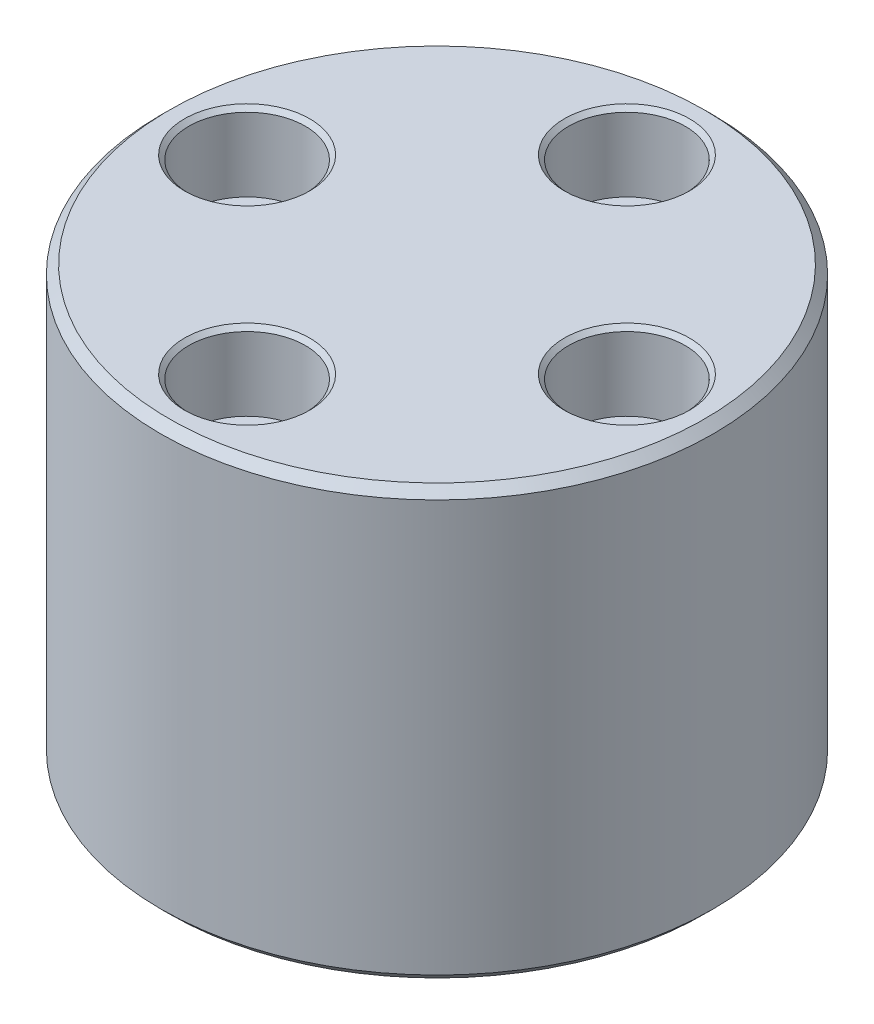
ISO-10303-21;
HEADER;
FILE_DESCRIPTION(('STEP AP214'),'2;1');
FILE_NAME('part.step','',(''),(''),'','','');
FILE_SCHEMA(('AUTOMOTIVE_DESIGN { 1 0 10303 214 1 1 1 1 }'));
ENDSEC;
DATA;
#1=APPLICATION_CONTEXT('core data for automotive mechanical design processes');
#2=APPLICATION_PROTOCOL_DEFINITION('international standard','automotive_design',2000,#1);
#3=PRODUCT_CONTEXT('',#1,'mechanical');
#4=PRODUCT('Part','Part','',(#3));
#5=PRODUCT_RELATED_PRODUCT_CATEGORY('part','',(#4));
#6=PRODUCT_DEFINITION_FORMATION('','',#4);
#7=PRODUCT_DEFINITION_CONTEXT('part definition',#1,'design');
#8=PRODUCT_DEFINITION('design','',#6,#7);
#9=PRODUCT_DEFINITION_SHAPE('','',#8);
#10=(LENGTH_UNIT() NAMED_UNIT(*) SI_UNIT(.MILLI.,.METRE.));
#11=(NAMED_UNIT(*) PLANE_ANGLE_UNIT() SI_UNIT($,.RADIAN.));
#12=(NAMED_UNIT(*) SI_UNIT($,.STERADIAN.) SOLID_ANGLE_UNIT());
#13=UNCERTAINTY_MEASURE_WITH_UNIT(LENGTH_MEASURE(1.E-05),#10,'distance_accuracy_value','');
#14=(GEOMETRIC_REPRESENTATION_CONTEXT(3) GLOBAL_UNCERTAINTY_ASSIGNED_CONTEXT((#13)) GLOBAL_UNIT_ASSIGNED_CONTEXT((#10,
#11,#12)) REPRESENTATION_CONTEXT('',''));
#15=CARTESIAN_POINT('',(0.,0.,0.));
#16=DIRECTION('',(0.,0.,1.));
#17=DIRECTION('',(1.,0.,0.));
#18=AXIS2_PLACEMENT_3D('',#15,#16,#17);
#19=CARTESIAN_POINT('',(0.,39.4208,0.));
#20=DIRECTION('',(0.,-1.,0.));
#21=DIRECTION('',(0.,0.,-1.));
#22=AXIS2_PLACEMENT_3D('',#19,#20,#21);
#23=CYLINDRICAL_SURFACE('',#22,25.4);
#24=CARTESIAN_POINT('',(0.,38.62705,0.));
#25=DIRECTION('',(0.,1.,0.));
#26=DIRECTION('',(0.,0.,1.));
#27=AXIS2_PLACEMENT_3D('',#24,#25,#26);
#28=CIRCLE('',#27,25.4);
#29=CARTESIAN_POINT('',(0.,38.62705,-25.4));
#30=VERTEX_POINT('',#29);
#31=EDGE_CURVE('E91',#30,#30,#28,.F.);
#32=ORIENTED_EDGE('',*,*,#31,.T.);
#33=EDGE_LOOP('',(#32));
#34=FACE_BOUND('',#33,.T.);
#35=CARTESIAN_POINT('',(0.,0.79375000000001,0.));
#36=DIRECTION('',(0.,1.,0.));
#37=DIRECTION('',(0.,0.,1.));
#38=AXIS2_PLACEMENT_3D('',#35,#36,#37);
#39=CIRCLE('',#38,25.4);
#40=CARTESIAN_POINT('',(0.,0.79375000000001,25.4));
#41=VERTEX_POINT('',#40);
#42=EDGE_CURVE('E94',#41,#41,#39,.T.);
#43=ORIENTED_EDGE('',*,*,#42,.T.);
#44=EDGE_LOOP('',(#43));
#45=FACE_BOUND('',#44,.T.);
#46=ADVANCED_FACE('F32',(#34,#45),#23,.T.);
#47=CARTESIAN_POINT('',(0.,39.4208,0.));
#48=DIRECTION('',(0.,1.,0.));
#49=DIRECTION('',(0.,0.,1.));
#50=AXIS2_PLACEMENT_3D('',#47,#48,#49);
#51=PLANE('',#50);
#52=CARTESIAN_POINT('',(0.,39.4208,17.4625));
#53=DIRECTION('',(0.,1.,0.));
#54=DIRECTION('',(0.,0.,1.));
#55=AXIS2_PLACEMENT_3D('',#52,#53,#54);
#56=CIRCLE('',#55,5.75627500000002);
#57=CARTESIAN_POINT('',(0.,39.4208,23.218775));
#58=VERTEX_POINT('',#57);
#59=EDGE_CURVE('E47',#58,#58,#56,.F.);
#60=ORIENTED_EDGE('',*,*,#59,.T.);
#61=EDGE_LOOP('',(#60));
#62=FACE_BOUND('',#61,.T.);
#63=CARTESIAN_POINT('',(17.4625,39.4208,0.));
#64=DIRECTION('',(0.,1.,0.));
#65=DIRECTION('',(0.,0.,1.));
#66=AXIS2_PLACEMENT_3D('',#63,#64,#65);
#67=CIRCLE('',#66,5.75627500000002);
#68=CARTESIAN_POINT('',(17.4625,39.4208,5.75627500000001));
#69=VERTEX_POINT('',#68);
#70=EDGE_CURVE('E52',#69,#69,#67,.F.);
#71=ORIENTED_EDGE('',*,*,#70,.T.);
#72=EDGE_LOOP('',(#71));
#73=FACE_BOUND('',#72,.T.);
#74=CARTESIAN_POINT('',(0.,39.4208,-17.4625));
#75=DIRECTION('',(0.,1.,0.));
#76=DIRECTION('',(0.,0.,1.));
#77=AXIS2_PLACEMENT_3D('',#74,#75,#76);
#78=CIRCLE('',#77,5.75627500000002);
#79=CARTESIAN_POINT('',(0.,39.4208,-11.706225));
#80=VERTEX_POINT('',#79);
#81=EDGE_CURVE('E55',#80,#80,#78,.F.);
#82=ORIENTED_EDGE('',*,*,#81,.T.);
#83=EDGE_LOOP('',(#82));
#84=FACE_BOUND('',#83,.T.);
#85=CARTESIAN_POINT('',(-17.4625,39.4208,0.));
#86=DIRECTION('',(0.,1.,0.));
#87=DIRECTION('',(0.,0.,1.));
#88=AXIS2_PLACEMENT_3D('',#85,#86,#87);
#89=CIRCLE('',#88,5.75627500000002);
#90=CARTESIAN_POINT('',(-17.4625,39.4208,5.75627500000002));
#91=VERTEX_POINT('',#90);
#92=EDGE_CURVE('E58',#91,#91,#89,.F.);
#93=ORIENTED_EDGE('',*,*,#92,.T.);
#94=EDGE_LOOP('',(#93));
#95=FACE_BOUND('',#94,.T.);
#96=CARTESIAN_POINT('',(0.,39.4208,0.));
#97=DIRECTION('',(0.,1.,0.));
#98=DIRECTION('',(0.,0.,1.));
#99=AXIS2_PLACEMENT_3D('',#96,#97,#98);
#100=CIRCLE('',#99,24.60625);
#101=CARTESIAN_POINT('',(0.,39.4208,-24.60625));
#102=VERTEX_POINT('',#101);
#103=EDGE_CURVE('E97',#102,#102,#100,.T.);
#104=ORIENTED_EDGE('',*,*,#103,.T.);
#105=EDGE_LOOP('',(#104));
#106=FACE_BOUND('',#105,.T.);
#107=ADVANCED_FACE('F142',(#62,#73,#84,#95,#106),#51,.T.);
#108=CARTESIAN_POINT('',(0.,0.,0.));
#109=DIRECTION('',(0.,1.,0.));
#110=DIRECTION('',(0.,0.,1.));
#111=AXIS2_PLACEMENT_3D('',#108,#109,#110);
#112=PLANE('',#111);
#113=CARTESIAN_POINT('',(0.,0.,17.4625));
#114=DIRECTION('',(0.,1.,0.));
#115=DIRECTION('',(0.,0.,1.));
#116=AXIS2_PLACEMENT_3D('',#113,#114,#115);
#117=CIRCLE('',#116,3.96811499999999);
#118=CARTESIAN_POINT('',(0.,0.,21.430615));
#119=VERTEX_POINT('',#118);
#120=EDGE_CURVE('E76',#119,#119,#117,.T.);
#121=ORIENTED_EDGE('',*,*,#120,.T.);
#122=EDGE_LOOP('',(#121));
#123=FACE_BOUND('',#122,.T.);
#124=CARTESIAN_POINT('',(17.4625,0.,0.));
#125=DIRECTION('',(0.,1.,0.));
#126=DIRECTION('',(0.,0.,1.));
#127=AXIS2_PLACEMENT_3D('',#124,#125,#126);
#128=CIRCLE('',#127,3.96811499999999);
#129=CARTESIAN_POINT('',(17.4625,0.,3.96811499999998));
#130=VERTEX_POINT('',#129);
#131=EDGE_CURVE('E79',#130,#130,#128,.T.);
#132=ORIENTED_EDGE('',*,*,#131,.T.);
#133=EDGE_LOOP('',(#132));
#134=FACE_BOUND('',#133,.T.);
#135=CARTESIAN_POINT('',(0.,0.,-17.4625));
#136=DIRECTION('',(0.,1.,0.));
#137=DIRECTION('',(0.,0.,1.));
#138=AXIS2_PLACEMENT_3D('',#135,#136,#137);
#139=CIRCLE('',#138,3.96811499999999);
#140=CARTESIAN_POINT('',(0.,0.,-13.494385));
#141=VERTEX_POINT('',#140);
#142=EDGE_CURVE('E82',#141,#141,#139,.T.);
#143=ORIENTED_EDGE('',*,*,#142,.T.);
#144=EDGE_LOOP('',(#143));
#145=FACE_BOUND('',#144,.T.);
#146=CARTESIAN_POINT('',(-17.4625,0.,0.));
#147=DIRECTION('',(0.,1.,0.));
#148=DIRECTION('',(0.,0.,1.));
#149=AXIS2_PLACEMENT_3D('',#146,#147,#148);
#150=CIRCLE('',#149,3.96811499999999);
#151=CARTESIAN_POINT('',(-17.4625,0.,3.96811499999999));
#152=VERTEX_POINT('',#151);
#153=EDGE_CURVE('E85',#152,#152,#150,.T.);
#154=ORIENTED_EDGE('',*,*,#153,.T.);
#155=EDGE_LOOP('',(#154));
#156=FACE_BOUND('',#155,.T.);
#157=CARTESIAN_POINT('',(0.,0.,0.));
#158=DIRECTION('',(0.,1.,0.));
#159=DIRECTION('',(0.,0.,1.));
#160=AXIS2_PLACEMENT_3D('',#157,#158,#159);
#161=CIRCLE('',#160,24.60625);
#162=CARTESIAN_POINT('',(0.,0.,24.60625));
#163=VERTEX_POINT('',#162);
#164=EDGE_CURVE('E88',#163,#163,#161,.F.);
#165=ORIENTED_EDGE('',*,*,#164,.T.);
#166=EDGE_LOOP('',(#165));
#167=FACE_BOUND('',#166,.T.);
#168=ADVANCED_FACE('F148',(#123,#134,#145,#156,#167),#112,.F.);
#169=CARTESIAN_POINT('',(17.4625,39.4208,0.));
#170=DIRECTION('',(0.,1.,0.));
#171=DIRECTION('',(0.,0.,1.));
#172=AXIS2_PLACEMENT_3D('',#169,#170,#171);
#173=CYLINDRICAL_SURFACE('',#172,3.57123999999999);
#174=CARTESIAN_POINT('',(17.4625,0.396874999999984,0.));
#175=DIRECTION('',(0.,1.,0.));
#176=DIRECTION('',(0.,0.,1.));
#177=AXIS2_PLACEMENT_3D('',#174,#175,#176);
#178=CIRCLE('',#177,3.57123999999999);
#179=CARTESIAN_POINT('',(17.4625,0.396874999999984,3.57123999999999));
#180=VERTEX_POINT('',#179);
#181=EDGE_CURVE('E70',#180,#180,#178,.F.);
#182=ORIENTED_EDGE('',*,*,#181,.T.);
#183=EDGE_LOOP('',(#182));
#184=FACE_BOUND('',#183,.T.);
#185=CARTESIAN_POINT('',(17.4625,32.27832,0.));
#186=DIRECTION('',(0.,1.,0.));
#187=DIRECTION('',(0.,0.,1.));
#188=AXIS2_PLACEMENT_3D('',#185,#186,#187);
#189=CIRCLE('',#188,3.57124);
#190=CARTESIAN_POINT('',(17.4625,32.27832,3.57124));
#191=VERTEX_POINT('',#190);
#192=EDGE_CURVE('E100',#191,#191,#189,.T.);
#193=ORIENTED_EDGE('',*,*,#192,.T.);
#194=EDGE_LOOP('',(#193));
#195=FACE_BOUND('',#194,.T.);
#196=ADVANCED_FACE('F317',(#184,#195),#173,.F.);
#197=CARTESIAN_POINT('',(21.03374,32.27832,0.));
#198=DIRECTION('',(0.,-1.,0.));
#199=DIRECTION('',(0.,0.,-1.));
#200=AXIS2_PLACEMENT_3D('',#197,#198,#199);
#201=PLANE('',#200);
#202=ORIENTED_EDGE('',*,*,#192,.F.);
#203=EDGE_LOOP('',(#202));
#204=FACE_BOUND('',#203,.T.);
#205=CARTESIAN_POINT('',(17.4625,32.27832,0.));
#206=DIRECTION('',(0.,1.,0.));
#207=DIRECTION('',(0.,0.,1.));
#208=AXIS2_PLACEMENT_3D('',#205,#206,#207);
#209=CIRCLE('',#208,5.3594);
#210=CARTESIAN_POINT('',(17.4625,32.27832,5.35939999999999));
#211=VERTEX_POINT('',#210);
#212=EDGE_CURVE('E103',#211,#211,#209,.T.);
#213=ORIENTED_EDGE('',*,*,#212,.T.);
#214=EDGE_LOOP('',(#213));
#215=FACE_BOUND('',#214,.T.);
#216=ADVANCED_FACE('F309',(#204,#215),#201,.F.);
#217=CARTESIAN_POINT('',(17.4625,39.4208,0.));
#218=DIRECTION('',(0.,1.,0.));
#219=DIRECTION('',(0.,0.,1.));
#220=AXIS2_PLACEMENT_3D('',#217,#218,#219);
#221=CYLINDRICAL_SURFACE('',#220,5.3594);
#222=CARTESIAN_POINT('',(17.4625,39.023925,0.));
#223=DIRECTION('',(0.,1.,0.));
#224=DIRECTION('',(0.,0.,1.));
#225=AXIS2_PLACEMENT_3D('',#222,#223,#224);
#226=CIRCLE('',#225,5.3594);
#227=CARTESIAN_POINT('',(17.4625,39.023925,5.35939999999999));
#228=VERTEX_POINT('',#227);
#229=EDGE_CURVE('E43',#228,#228,#226,.T.);
#230=ORIENTED_EDGE('',*,*,#229,.T.);
#231=EDGE_LOOP('',(#230));
#232=FACE_BOUND('',#231,.T.);
#233=ORIENTED_EDGE('',*,*,#212,.F.);
#234=EDGE_LOOP('',(#233));
#235=FACE_BOUND('',#234,.T.);
#236=ADVANCED_FACE('F299',(#232,#235),#221,.F.);
#237=CARTESIAN_POINT('',(-17.4625,39.4208,0.));
#238=DIRECTION('',(0.,1.,0.));
#239=DIRECTION('',(0.,0.,1.));
#240=AXIS2_PLACEMENT_3D('',#237,#238,#239);
#241=CYLINDRICAL_SURFACE('',#240,3.57123999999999);
#242=CARTESIAN_POINT('',(-17.4625,0.396874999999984,0.));
#243=DIRECTION('',(0.,1.,0.));
#244=DIRECTION('',(0.,0.,1.));
#245=AXIS2_PLACEMENT_3D('',#242,#243,#244);
#246=CIRCLE('',#245,3.57123999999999);
#247=CARTESIAN_POINT('',(-17.4625,0.396874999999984,3.57123999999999));
#248=VERTEX_POINT('',#247);
#249=EDGE_CURVE('E64',#248,#248,#246,.F.);
#250=ORIENTED_EDGE('',*,*,#249,.T.);
#251=EDGE_LOOP('',(#250));
#252=FACE_BOUND('',#251,.T.);
#253=CARTESIAN_POINT('',(-17.4625,32.27832,0.));
#254=DIRECTION('',(0.,1.,0.));
#255=DIRECTION('',(0.,0.,1.));
#256=AXIS2_PLACEMENT_3D('',#253,#254,#255);
#257=CIRCLE('',#256,3.57124);
#258=CARTESIAN_POINT('',(-17.4625,32.27832,3.57124));
#259=VERTEX_POINT('',#258);
#260=EDGE_CURVE('E106',#259,#259,#257,.T.);
#261=ORIENTED_EDGE('',*,*,#260,.T.);
#262=EDGE_LOOP('',(#261));
#263=FACE_BOUND('',#262,.T.);
#264=ADVANCED_FACE('F294',(#252,#263),#241,.F.);
#265=CARTESIAN_POINT('',(-13.89126,32.27832,0.));
#266=DIRECTION('',(0.,-1.,0.));
#267=DIRECTION('',(0.,0.,-1.));
#268=AXIS2_PLACEMENT_3D('',#265,#266,#267);
#269=PLANE('',#268);
#270=ORIENTED_EDGE('',*,*,#260,.F.);
#271=EDGE_LOOP('',(#270));
#272=FACE_BOUND('',#271,.T.);
#273=CARTESIAN_POINT('',(-17.4625,32.27832,0.));
#274=DIRECTION('',(0.,1.,0.));
#275=DIRECTION('',(0.,0.,1.));
#276=AXIS2_PLACEMENT_3D('',#273,#274,#275);
#277=CIRCLE('',#276,5.3594);
#278=CARTESIAN_POINT('',(-17.4625,32.27832,5.3594));
#279=VERTEX_POINT('',#278);
#280=EDGE_CURVE('E109',#279,#279,#277,.T.);
#281=ORIENTED_EDGE('',*,*,#280,.T.);
#282=EDGE_LOOP('',(#281));
#283=FACE_BOUND('',#282,.T.);
#284=ADVANCED_FACE('F287',(#272,#283),#269,.F.);
#285=CARTESIAN_POINT('',(-17.4625,39.4208,0.));
#286=DIRECTION('',(0.,1.,0.));
#287=DIRECTION('',(0.,0.,1.));
#288=AXIS2_PLACEMENT_3D('',#285,#286,#287);
#289=CYLINDRICAL_SURFACE('',#288,5.3594);
#290=CARTESIAN_POINT('',(-17.4625,39.023925,0.));
#291=DIRECTION('',(0.,1.,0.));
#292=DIRECTION('',(0.,0.,1.));
#293=AXIS2_PLACEMENT_3D('',#290,#291,#292);
#294=CIRCLE('',#293,5.3594);
#295=CARTESIAN_POINT('',(-17.4625,39.023925,5.3594));
#296=VERTEX_POINT('',#295);
#297=EDGE_CURVE('E10',#296,#296,#294,.T.);
#298=ORIENTED_EDGE('',*,*,#297,.T.);
#299=EDGE_LOOP('',(#298));
#300=FACE_BOUND('',#299,.T.);
#301=ORIENTED_EDGE('',*,*,#280,.F.);
#302=EDGE_LOOP('',(#301));
#303=FACE_BOUND('',#302,.T.);
#304=ADVANCED_FACE('F277',(#300,#303),#289,.F.);
#305=CARTESIAN_POINT('',(0.,39.4208,17.4625));
#306=DIRECTION('',(0.,1.,0.));
#307=DIRECTION('',(0.,0.,1.));
#308=AXIS2_PLACEMENT_3D('',#305,#306,#307);
#309=CYLINDRICAL_SURFACE('',#308,3.57123999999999);
#310=CARTESIAN_POINT('',(0.,0.396874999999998,17.4625));
#311=DIRECTION('',(0.,1.,0.));
#312=DIRECTION('',(0.,0.,1.));
#313=AXIS2_PLACEMENT_3D('',#310,#311,#312);
#314=CIRCLE('',#313,3.57123999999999);
#315=CARTESIAN_POINT('',(0.,0.396874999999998,21.03374));
#316=VERTEX_POINT('',#315);
#317=EDGE_CURVE('E73',#316,#316,#314,.F.);
#318=ORIENTED_EDGE('',*,*,#317,.T.);
#319=EDGE_LOOP('',(#318));
#320=FACE_BOUND('',#319,.T.);
#321=CARTESIAN_POINT('',(0.,32.27832,17.4625));
#322=DIRECTION('',(0.,1.,0.));
#323=DIRECTION('',(0.,0.,1.));
#324=AXIS2_PLACEMENT_3D('',#321,#322,#323);
#325=CIRCLE('',#324,3.57124);
#326=CARTESIAN_POINT('',(0.,32.27832,21.03374));
#327=VERTEX_POINT('',#326);
#328=EDGE_CURVE('E112',#327,#327,#325,.T.);
#329=ORIENTED_EDGE('',*,*,#328,.T.);
#330=EDGE_LOOP('',(#329));
#331=FACE_BOUND('',#330,.T.);
#332=ADVANCED_FACE('F272',(#320,#331),#309,.F.);
#333=CARTESIAN_POINT('',(3.57124,32.27832,17.4625));
#334=DIRECTION('',(0.,-1.,0.));
#335=DIRECTION('',(0.,0.,-1.));
#336=AXIS2_PLACEMENT_3D('',#333,#334,#335);
#337=PLANE('',#336);
#338=ORIENTED_EDGE('',*,*,#328,.F.);
#339=EDGE_LOOP('',(#338));
#340=FACE_BOUND('',#339,.T.);
#341=CARTESIAN_POINT('',(0.,32.27832,17.4625));
#342=DIRECTION('',(0.,1.,0.));
#343=DIRECTION('',(0.,0.,1.));
#344=AXIS2_PLACEMENT_3D('',#341,#342,#343);
#345=CIRCLE('',#344,5.3594);
#346=CARTESIAN_POINT('',(0.,32.27832,22.8219));
#347=VERTEX_POINT('',#346);
#348=EDGE_CURVE('E115',#347,#347,#345,.T.);
#349=ORIENTED_EDGE('',*,*,#348,.T.);
#350=EDGE_LOOP('',(#349));
#351=FACE_BOUND('',#350,.T.);
#352=ADVANCED_FACE('F264',(#340,#351),#337,.F.);
#353=CARTESIAN_POINT('',(0.,39.4208,17.4625));
#354=DIRECTION('',(0.,1.,0.));
#355=DIRECTION('',(0.,0.,1.));
#356=AXIS2_PLACEMENT_3D('',#353,#354,#355);
#357=CYLINDRICAL_SURFACE('',#356,5.3594);
#358=CARTESIAN_POINT('',(0.,39.023925,17.4625));
#359=DIRECTION('',(0.,1.,0.));
#360=DIRECTION('',(0.,0.,1.));
#361=AXIS2_PLACEMENT_3D('',#358,#359,#360);
#362=CIRCLE('',#361,5.3594);
#363=CARTESIAN_POINT('',(0.,39.023925,22.8219));
#364=VERTEX_POINT('',#363);
#365=EDGE_CURVE('E61',#364,#364,#362,.T.);
#366=ORIENTED_EDGE('',*,*,#365,.T.);
#367=EDGE_LOOP('',(#366));
#368=FACE_BOUND('',#367,.T.);
#369=ORIENTED_EDGE('',*,*,#348,.F.);
#370=EDGE_LOOP('',(#369));
#371=FACE_BOUND('',#370,.T.);
#372=ADVANCED_FACE('F254',(#368,#371),#357,.F.);
#373=CARTESIAN_POINT('',(0.,39.4208,-17.4625));
#374=DIRECTION('',(0.,1.,0.));
#375=DIRECTION('',(0.,0.,1.));
#376=AXIS2_PLACEMENT_3D('',#373,#374,#375);
#377=CYLINDRICAL_SURFACE('',#376,3.57123999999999);
#378=CARTESIAN_POINT('',(0.,0.396874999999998,-17.4625));
#379=DIRECTION('',(0.,1.,0.));
#380=DIRECTION('',(0.,0.,1.));
#381=AXIS2_PLACEMENT_3D('',#378,#379,#380);
#382=CIRCLE('',#381,3.57123999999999);
#383=CARTESIAN_POINT('',(0.,0.396874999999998,-13.89126));
#384=VERTEX_POINT('',#383);
#385=EDGE_CURVE('E67',#384,#384,#382,.F.);
#386=ORIENTED_EDGE('',*,*,#385,.T.);
#387=EDGE_LOOP('',(#386));
#388=FACE_BOUND('',#387,.T.);
#389=CARTESIAN_POINT('',(0.,32.27832,-17.4625));
#390=DIRECTION('',(0.,1.,0.));
#391=DIRECTION('',(0.,0.,1.));
#392=AXIS2_PLACEMENT_3D('',#389,#390,#391);
#393=CIRCLE('',#392,3.57124);
#394=CARTESIAN_POINT('',(0.,32.27832,-13.89126));
#395=VERTEX_POINT('',#394);
#396=EDGE_CURVE('E118',#395,#395,#393,.T.);
#397=ORIENTED_EDGE('',*,*,#396,.T.);
#398=EDGE_LOOP('',(#397));
#399=FACE_BOUND('',#398,.T.);
#400=ADVANCED_FACE('F138',(#388,#399),#377,.F.);
#401=CARTESIAN_POINT('',(3.57124,32.27832,-17.4625));
#402=DIRECTION('',(0.,-1.,0.));
#403=DIRECTION('',(0.,0.,-1.));
#404=AXIS2_PLACEMENT_3D('',#401,#402,#403);
#405=PLANE('',#404);
#406=ORIENTED_EDGE('',*,*,#396,.F.);
#407=EDGE_LOOP('',(#406));
#408=FACE_BOUND('',#407,.T.);
#409=CARTESIAN_POINT('',(0.,32.27832,-17.4625));
#410=DIRECTION('',(0.,1.,0.));
#411=DIRECTION('',(0.,0.,1.));
#412=AXIS2_PLACEMENT_3D('',#409,#410,#411);
#413=CIRCLE('',#412,5.3594);
#414=CARTESIAN_POINT('',(0.,32.27832,-12.1031));
#415=VERTEX_POINT('',#414);
#416=EDGE_CURVE('E121',#415,#415,#413,.T.);
#417=ORIENTED_EDGE('',*,*,#416,.T.);
#418=EDGE_LOOP('',(#417));
#419=FACE_BOUND('',#418,.T.);
#420=ADVANCED_FACE('F125',(#408,#419),#405,.F.);
#421=CARTESIAN_POINT('',(0.,39.4208,-17.4625));
#422=DIRECTION('',(0.,1.,0.));
#423=DIRECTION('',(0.,0.,1.));
#424=AXIS2_PLACEMENT_3D('',#421,#422,#423);
#425=CYLINDRICAL_SURFACE('',#424,5.3594);
#426=CARTESIAN_POINT('',(0.,39.023925,-17.4625));
#427=DIRECTION('',(0.,1.,0.));
#428=DIRECTION('',(0.,0.,1.));
#429=AXIS2_PLACEMENT_3D('',#426,#427,#428);
#430=CIRCLE('',#429,5.3594);
#431=CARTESIAN_POINT('',(0.,39.023925,-12.1031));
#432=VERTEX_POINT('',#431);
#433=EDGE_CURVE('E39',#432,#432,#430,.T.);
#434=ORIENTED_EDGE('',*,*,#433,.T.);
#435=EDGE_LOOP('',(#434));
#436=FACE_BOUND('',#435,.T.);
#437=ORIENTED_EDGE('',*,*,#416,.F.);
#438=EDGE_LOOP('',(#437));
#439=FACE_BOUND('',#438,.T.);
#440=ADVANCED_FACE('F127',(#436,#439),#425,.F.);
#441=CARTESIAN_POINT('',(0.,39.4208,0.));
#442=DIRECTION('',(0.,-1.,0.));
#443=DIRECTION('',(0.,0.,-1.));
#444=AXIS2_PLACEMENT_3D('',#441,#442,#443);
#445=CONICAL_SURFACE('',#444,24.60625,0.785398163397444);
#446=CARTESIAN_POINT('',(0.,38.62705,-25.4));
#447=CARTESIAN_POINT('',(0.,38.6353182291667,-25.3917317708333));
#448=CARTESIAN_POINT('',(0.,38.6435864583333,-25.3834635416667));
#449=CARTESIAN_POINT('',(0.,38.6601229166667,-25.3669270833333));
#450=CARTESIAN_POINT('',(0.,38.6683911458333,-25.3586588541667));
#451=CARTESIAN_POINT('',(0.,38.6849276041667,-25.3421223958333));
#452=CARTESIAN_POINT('',(0.,38.6931958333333,-25.3338541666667));
#453=CARTESIAN_POINT('',(0.,38.7097322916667,-25.3173177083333));
#454=CARTESIAN_POINT('',(0.,38.7180005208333,-25.3090494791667));
#455=CARTESIAN_POINT('',(0.,38.7345369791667,-25.2925130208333));
#456=CARTESIAN_POINT('',(0.,38.7428052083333,-25.2842447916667));
#457=CARTESIAN_POINT('',(0.,38.7593416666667,-25.2677083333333));
#458=CARTESIAN_POINT('',(0.,38.7676098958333,-25.2594401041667));
#459=CARTESIAN_POINT('',(0.,38.7841463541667,-25.2429036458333));
#460=CARTESIAN_POINT('',(0.,38.7924145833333,-25.2346354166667));
#461=CARTESIAN_POINT('',(0.,38.8089510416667,-25.2180989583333));
#462=CARTESIAN_POINT('',(0.,38.8172192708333,-25.2098307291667));
#463=CARTESIAN_POINT('',(0.,38.8337557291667,-25.1932942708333));
#464=CARTESIAN_POINT('',(0.,38.8420239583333,-25.1850260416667));
#465=CARTESIAN_POINT('',(0.,38.8585604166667,-25.1684895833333));
#466=CARTESIAN_POINT('',(0.,38.8668286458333,-25.1602213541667));
#467=CARTESIAN_POINT('',(0.,38.8833651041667,-25.1436848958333));
#468=CARTESIAN_POINT('',(0.,38.8916333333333,-25.1354166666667));
#469=CARTESIAN_POINT('',(0.,38.9081697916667,-25.1188802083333));
#470=CARTESIAN_POINT('',(0.,38.9164380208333,-25.1106119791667));
#471=CARTESIAN_POINT('',(0.,38.9329744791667,-25.0940755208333));
#472=CARTESIAN_POINT('',(0.,38.9412427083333,-25.0858072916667));
#473=CARTESIAN_POINT('',(0.,38.9577791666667,-25.0692708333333));
#474=CARTESIAN_POINT('',(0.,38.9660473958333,-25.0610026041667));
#475=CARTESIAN_POINT('',(0.,38.9825838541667,-25.0444661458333));
#476=CARTESIAN_POINT('',(0.,38.9908520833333,-25.0361979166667));
#477=CARTESIAN_POINT('',(0.,39.0073885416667,-25.0196614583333));
#478=CARTESIAN_POINT('',(0.,39.0156567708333,-25.0113932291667));
#479=CARTESIAN_POINT('',(0.,39.0321932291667,-24.9948567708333));
#480=CARTESIAN_POINT('',(0.,39.0404614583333,-24.9865885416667));
#481=CARTESIAN_POINT('',(0.,39.0569979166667,-24.9700520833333));
#482=CARTESIAN_POINT('',(0.,39.0652661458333,-24.9617838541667));
#483=CARTESIAN_POINT('',(0.,39.0818026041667,-24.9452473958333));
#484=CARTESIAN_POINT('',(0.,39.0900708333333,-24.9369791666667));
#485=CARTESIAN_POINT('',(0.,39.1066072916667,-24.9204427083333));
#486=CARTESIAN_POINT('',(0.,39.1148755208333,-24.9121744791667));
#487=CARTESIAN_POINT('',(0.,39.1314119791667,-24.8956380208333));
#488=CARTESIAN_POINT('',(0.,39.1396802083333,-24.8873697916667));
#489=CARTESIAN_POINT('',(0.,39.1562166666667,-24.8708333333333));
#490=CARTESIAN_POINT('',(0.,39.1644848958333,-24.8625651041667));
#491=CARTESIAN_POINT('',(0.,39.1810213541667,-24.8460286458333));
#492=CARTESIAN_POINT('',(0.,39.1892895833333,-24.8377604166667));
#493=CARTESIAN_POINT('',(0.,39.2058260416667,-24.8212239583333));
#494=CARTESIAN_POINT('',(0.,39.2140942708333,-24.8129557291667));
#495=CARTESIAN_POINT('',(0.,39.2306307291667,-24.7964192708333));
#496=CARTESIAN_POINT('',(0.,39.2388989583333,-24.7881510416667));
#497=CARTESIAN_POINT('',(0.,39.2554354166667,-24.7716145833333));
#498=CARTESIAN_POINT('',(0.,39.2637036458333,-24.7633463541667));
#499=CARTESIAN_POINT('',(0.,39.2802401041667,-24.7468098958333));
#500=CARTESIAN_POINT('',(0.,39.2885083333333,-24.7385416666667));
#501=CARTESIAN_POINT('',(0.,39.3050447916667,-24.7220052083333));
#502=CARTESIAN_POINT('',(0.,39.3133130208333,-24.7137369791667));
#503=CARTESIAN_POINT('',(0.,39.3298494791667,-24.6972005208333));
#504=CARTESIAN_POINT('',(0.,39.3381177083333,-24.6889322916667));
#505=CARTESIAN_POINT('',(0.,39.3546541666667,-24.6723958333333));
#506=CARTESIAN_POINT('',(0.,39.3629223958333,-24.6641276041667));
#507=CARTESIAN_POINT('',(0.,39.3794588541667,-24.6475911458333));
#508=CARTESIAN_POINT('',(0.,39.3877270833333,-24.6393229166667));
#509=CARTESIAN_POINT('',(0.,39.4042635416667,-24.6227864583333));
#510=CARTESIAN_POINT('',(0.,39.4125317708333,-24.6145182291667));
#511=CARTESIAN_POINT('',(0.,39.4208,-24.60625));
#512=B_SPLINE_CURVE_WITH_KNOTS('',3,(#446,#447,#448,#449,#450,#451,#452,#453,#454,#455,#456,
#457,#458,#459,#460,#461,#462,#463,#464,#465,#466,#467,#468,#469,#470,#471,#472,#473,#474,#475,
#476,#477,#478,#479,#480,#481,#482,#483,#484,#485,#486,#487,#488,#489,#490,#491,#492,#493,#494,
#495,#496,#497,#498,#499,#500,#501,#502,#503,#504,#505,#506,#507,#508,#509,#510,#511),
.UNSPECIFIED.,.F.,.F.,(4,2,2,2,2,2,2,2,2,2,2,2,2,2,2,2,2,2,2,2,2,2,2,2,2,2,2,2,2,2,2,2,4),(0.,
0.0350791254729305,0.0701582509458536,0.105237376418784,0.140316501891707,0.175395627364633,
0.210474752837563,0.245553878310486,0.280633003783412,0.315712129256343,0.350791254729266,
0.385870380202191,0.420949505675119,0.456028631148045,0.491107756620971,0.526186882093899,
0.561266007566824,0.59634513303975,0.631424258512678,0.666503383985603,0.701582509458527,
0.736661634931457,0.771740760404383,0.806819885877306,0.841899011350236,0.876978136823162,
0.912057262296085,0.947136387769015,0.982215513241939,1.01729463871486,1.05237376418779,
1.08745288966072,1.12253201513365),.UNSPECIFIED.);
#513=EDGE_CURVE('BSEAM129',#30,#102,#512,.T.);
#514=ORIENTED_EDGE('',*,*,#31,.F.);
#515=ORIENTED_EDGE('',*,*,#103,.F.);
#516=ORIENTED_EDGE('',*,*,#513,.T.);
#517=ORIENTED_EDGE('',*,*,#513,.F.);
#518=EDGE_LOOP('',(#514,#516,#515,#517));
#519=FACE_BOUND('',#518,.T.);
#520=ADVANCED_FACE('F129',(#519),#445,.T.);
#521=CARTESIAN_POINT('',(0.,0.79375000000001,0.));
#522=DIRECTION('',(0.,1.,0.));
#523=DIRECTION('',(0.,0.,1.));
#524=AXIS2_PLACEMENT_3D('',#521,#522,#523);
#525=CONICAL_SURFACE('',#524,25.4,0.785398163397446);
#526=ORIENTED_EDGE('',*,*,#164,.F.);
#527=EDGE_LOOP('',(#526));
#528=FACE_BOUND('',#527,.T.);
#529=ORIENTED_EDGE('',*,*,#42,.F.);
#530=EDGE_LOOP('',(#529));
#531=FACE_BOUND('',#530,.T.);
#532=ADVANCED_FACE('F135',(#528,#531),#525,.T.);
#533=CARTESIAN_POINT('',(0.,0.,17.4625));
#534=DIRECTION('',(0.,-1.,0.));
#535=DIRECTION('',(0.,0.,-1.));
#536=AXIS2_PLACEMENT_3D('',#533,#534,#535);
#537=CONICAL_SURFACE('',#536,3.96811499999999,0.785398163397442);
#538=ORIENTED_EDGE('',*,*,#317,.F.);
#539=EDGE_LOOP('',(#538));
#540=FACE_BOUND('',#539,.T.);
#541=ORIENTED_EDGE('',*,*,#120,.F.);
#542=EDGE_LOOP('',(#541));
#543=FACE_BOUND('',#542,.T.);
#544=ADVANCED_FACE('F156',(#540,#543),#537,.F.);
#545=CARTESIAN_POINT('',(17.4625,0.,0.));
#546=DIRECTION('',(0.,-1.,0.));
#547=DIRECTION('',(0.,0.,-1.));
#548=AXIS2_PLACEMENT_3D('',#545,#546,#547);
#549=CONICAL_SURFACE('',#548,3.96811499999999,0.785398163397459);
#550=ORIENTED_EDGE('',*,*,#181,.F.);
#551=EDGE_LOOP('',(#550));
#552=FACE_BOUND('',#551,.T.);
#553=ORIENTED_EDGE('',*,*,#131,.F.);
#554=EDGE_LOOP('',(#553));
#555=FACE_BOUND('',#554,.T.);
#556=ADVANCED_FACE('F160',(#552,#555),#549,.F.);
#557=CARTESIAN_POINT('',(0.,0.,-17.4625));
#558=DIRECTION('',(0.,-1.,0.));
#559=DIRECTION('',(0.,0.,-1.));
#560=AXIS2_PLACEMENT_3D('',#557,#558,#559);
#561=CONICAL_SURFACE('',#560,3.96811499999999,0.78539816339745);
#562=ORIENTED_EDGE('',*,*,#385,.F.);
#563=EDGE_LOOP('',(#562));
#564=FACE_BOUND('',#563,.T.);
#565=ORIENTED_EDGE('',*,*,#142,.F.);
#566=EDGE_LOOP('',(#565));
#567=FACE_BOUND('',#566,.T.);
#568=ADVANCED_FACE('F164',(#564,#567),#561,.F.);
#569=CARTESIAN_POINT('',(-17.4625,0.,0.));
#570=DIRECTION('',(0.,-1.,0.));
#571=DIRECTION('',(0.,0.,-1.));
#572=AXIS2_PLACEMENT_3D('',#569,#570,#571);
#573=CONICAL_SURFACE('',#572,3.96811499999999,0.785398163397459);
#574=ORIENTED_EDGE('',*,*,#249,.F.);
#575=EDGE_LOOP('',(#574));
#576=FACE_BOUND('',#575,.T.);
#577=ORIENTED_EDGE('',*,*,#153,.F.);
#578=EDGE_LOOP('',(#577));
#579=FACE_BOUND('',#578,.T.);
#580=ADVANCED_FACE('F168',(#576,#579),#573,.F.);
#581=CARTESIAN_POINT('',(0.,39.023925,17.4625));
#582=DIRECTION('',(0.,1.,0.));
#583=DIRECTION('',(0.,0.,1.));
#584=AXIS2_PLACEMENT_3D('',#581,#582,#583);
#585=CONICAL_SURFACE('',#584,5.3594,0.785398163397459);
#586=ORIENTED_EDGE('',*,*,#59,.F.);
#587=EDGE_LOOP('',(#586));
#588=FACE_BOUND('',#587,.T.);
#589=ORIENTED_EDGE('',*,*,#365,.F.);
#590=EDGE_LOOP('',(#589));
#591=FACE_BOUND('',#590,.T.);
#592=ADVANCED_FACE('F172',(#588,#591),#585,.F.);
#593=CARTESIAN_POINT('',(17.4625,39.023925,0.));
#594=DIRECTION('',(0.,1.,0.));
#595=DIRECTION('',(0.,0.,1.));
#596=AXIS2_PLACEMENT_3D('',#593,#594,#595);
#597=CONICAL_SURFACE('',#596,5.3594,0.785398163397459);
#598=ORIENTED_EDGE('',*,*,#70,.F.);
#599=EDGE_LOOP('',(#598));
#600=FACE_BOUND('',#599,.T.);
#601=ORIENTED_EDGE('',*,*,#229,.F.);
#602=EDGE_LOOP('',(#601));
#603=FACE_BOUND('',#602,.T.);
#604=ADVANCED_FACE('F176',(#600,#603),#597,.F.);
#605=CARTESIAN_POINT('',(0.,39.023925,-17.4625));
#606=DIRECTION('',(0.,1.,0.));
#607=DIRECTION('',(0.,0.,1.));
#608=AXIS2_PLACEMENT_3D('',#605,#606,#607);
#609=CONICAL_SURFACE('',#608,5.3594,0.785398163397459);
#610=ORIENTED_EDGE('',*,*,#81,.F.);
#611=EDGE_LOOP('',(#610));
#612=FACE_BOUND('',#611,.T.);
#613=ORIENTED_EDGE('',*,*,#433,.F.);
#614=EDGE_LOOP('',(#613));
#615=FACE_BOUND('',#614,.T.);
#616=ADVANCED_FACE('F179',(#612,#615),#609,.F.);
#617=CARTESIAN_POINT('',(-17.4625,39.023925,0.));
#618=DIRECTION('',(0.,1.,0.));
#619=DIRECTION('',(0.,0.,1.));
#620=AXIS2_PLACEMENT_3D('',#617,#618,#619);
#621=CONICAL_SURFACE('',#620,5.3594,0.78539816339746);
#622=ORIENTED_EDGE('',*,*,#92,.F.);
#623=EDGE_LOOP('',(#622));
#624=FACE_BOUND('',#623,.T.);
#625=ORIENTED_EDGE('',*,*,#297,.F.);
#626=EDGE_LOOP('',(#625));
#627=FACE_BOUND('',#626,.T.);
#628=ADVANCED_FACE('F34',(#624,#627),#621,.F.);
#629=CLOSED_SHELL('',(#46,#107,#168,#196,#216,#236,#264,#284,#304,#332,#352,#372,#400,#420,#440,
#520,#532,#544,#556,#568,#580,#592,#604,#616,#628));
#630=MANIFOLD_SOLID_BREP('B2',#629);
#631=ADVANCED_BREP_SHAPE_REPRESENTATION('',(#18,#630),#14);
#632=SHAPE_DEFINITION_REPRESENTATION(#9,#631);
ENDSEC;
END-ISO-10303-21;
